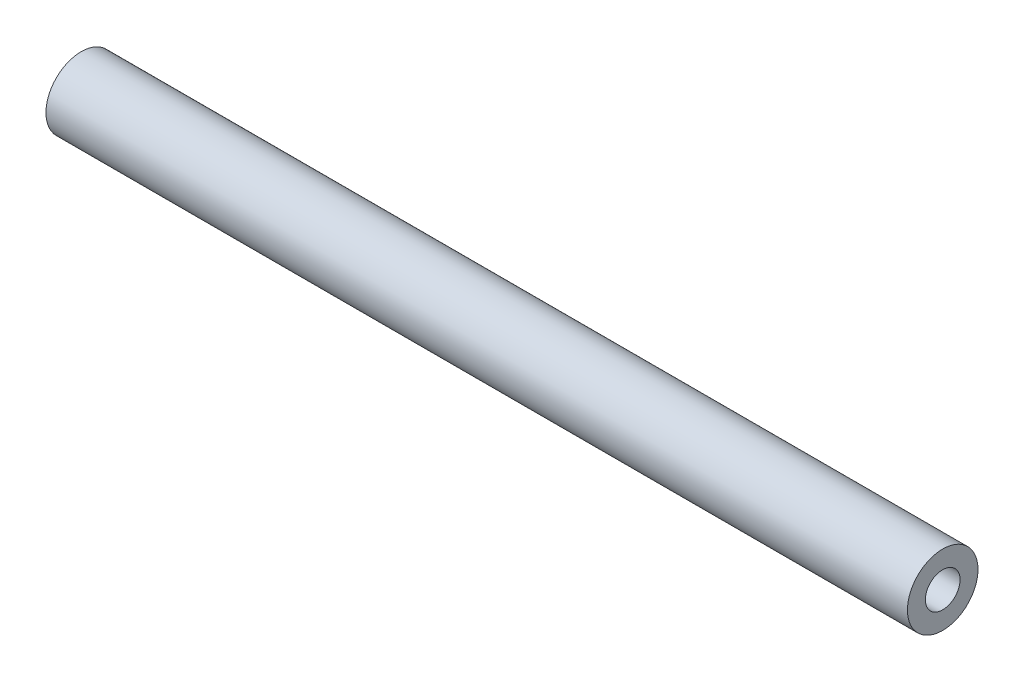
from build123d import *

# Parameters (mm, degrees)
SKETCH1_R           = 6.35
SKETCH1_R_2         = 3.125
BOSS_EXTRUDE1_DEPTH = 155


with BuildPart() as part:
    # Sketch1 → Boss-Extrude1 (new body)
    with BuildSketch(Plane(origin=(0, 0, 0), x_dir=(0, 0, -1), z_dir=(1, 0, 0))):
        Circle(SKETCH1_R)
        Circle(SKETCH1_R_2, mode=Mode.SUBTRACT)
    extrude(amount=BOSS_EXTRUDE1_DEPTH)


solid = part.part
